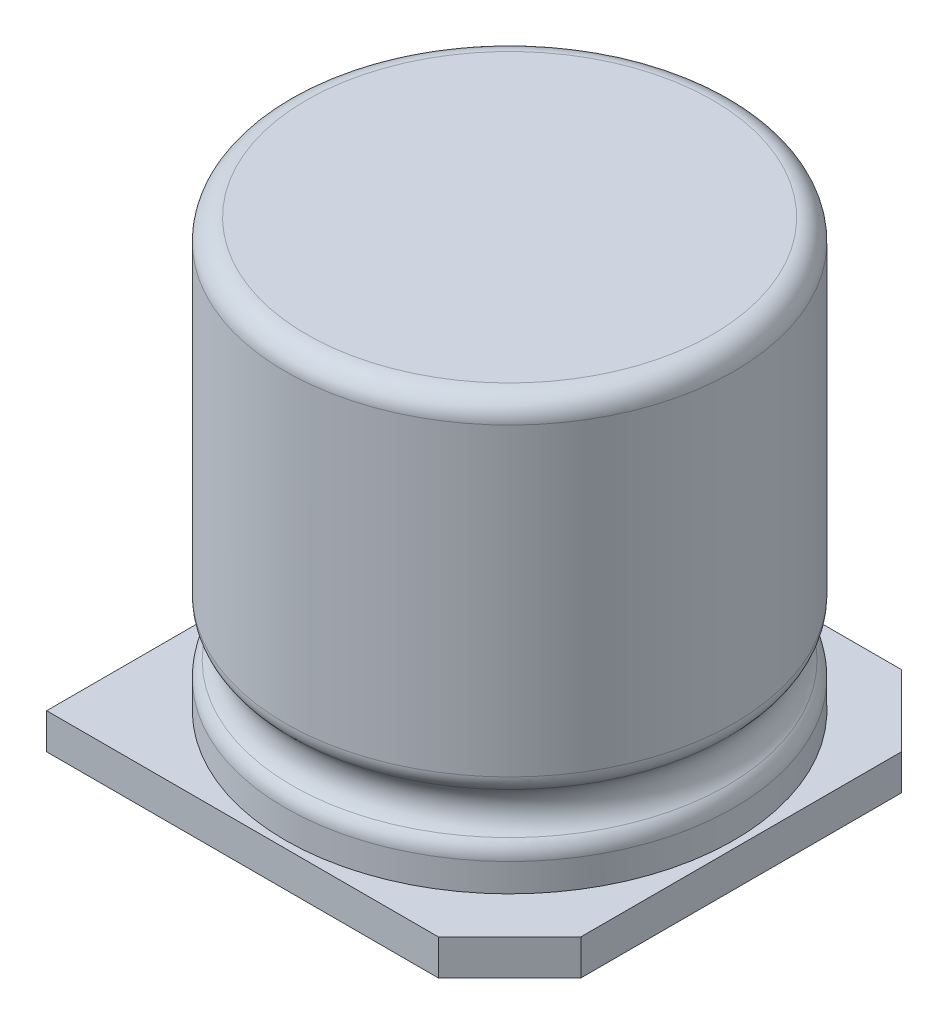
ISO-10303-21;
HEADER;
FILE_DESCRIPTION(('STEP AP214'),'2;1');
FILE_NAME('part.step','',(''),(''),'','','');
FILE_SCHEMA(('AUTOMOTIVE_DESIGN { 1 0 10303 214 1 1 1 1 }'));
ENDSEC;
DATA;
#1=APPLICATION_CONTEXT('core data for automotive mechanical design processes');
#2=APPLICATION_PROTOCOL_DEFINITION('international standard','automotive_design',2000,#1);
#3=PRODUCT_CONTEXT('',#1,'mechanical');
#4=PRODUCT('Part','Part','',(#3));
#5=PRODUCT_RELATED_PRODUCT_CATEGORY('part','',(#4));
#6=PRODUCT_DEFINITION_FORMATION('','',#4);
#7=PRODUCT_DEFINITION_CONTEXT('part definition',#1,'design');
#8=PRODUCT_DEFINITION('design','',#6,#7);
#9=PRODUCT_DEFINITION_SHAPE('','',#8);
#10=(LENGTH_UNIT() NAMED_UNIT(*) SI_UNIT(.MILLI.,.METRE.));
#11=(NAMED_UNIT(*) PLANE_ANGLE_UNIT() SI_UNIT($,.RADIAN.));
#12=(NAMED_UNIT(*) SI_UNIT($,.STERADIAN.) SOLID_ANGLE_UNIT());
#13=UNCERTAINTY_MEASURE_WITH_UNIT(LENGTH_MEASURE(1.E-05),#10,'distance_accuracy_value','');
#14=(GEOMETRIC_REPRESENTATION_CONTEXT(3) GLOBAL_UNCERTAINTY_ASSIGNED_CONTEXT((#13)) GLOBAL_UNIT_ASSIGNED_CONTEXT((#10,
#11,#12)) REPRESENTATION_CONTEXT('',''));
#15=CARTESIAN_POINT('',(0.,0.,0.));
#16=DIRECTION('',(0.,0.,1.));
#17=DIRECTION('',(1.,0.,0.));
#18=AXIS2_PLACEMENT_3D('',#15,#16,#17);
#19=CARTESIAN_POINT('',(29.11856,18.034,-32.9285599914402));
#20=DIRECTION('',(0.,1.,0.));
#21=DIRECTION('',(-1.,0.,0.));
#22=AXIS2_PLACEMENT_3D('',#19,#20,#21);
#23=PLANE('',#22);
#24=CARTESIAN_POINT('',(21.59,18.034,-25.4));
#25=DIRECTION('',(0.,-1.,0.));
#26=DIRECTION('',(1.,0.,1.39228393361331E-12));
#27=AXIS2_PLACEMENT_3D('',#24,#25,#26);
#28=CIRCLE('',#27,7.23899999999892);
#29=CARTESIAN_POINT('',(14.3510000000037,18.034,-25.4000000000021));
#30=VERTEX_POINT('',#29);
#31=CARTESIAN_POINT('',(28.8289999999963,18.034,-25.3999999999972));
#32=VERTEX_POINT('',#31);
#33=EDGE_CURVE('E82',#30,#32,#28,.F.);
#34=ORIENTED_EDGE('',*,*,#33,.T.);
#35=CARTESIAN_POINT('',(14.3510000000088,18.034,-25.4000000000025));
#36=CARTESIAN_POINT('',(14.3509997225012,18.034,-25.4430710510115));
#37=CARTESIAN_POINT('',(14.351383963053,18.0339999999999,-25.4861421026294));
#38=CARTESIAN_POINT('',(14.352921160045,18.0339999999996,-25.5722705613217));
#39=CARTESIAN_POINT('',(14.3540741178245,18.0339999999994,-25.6153279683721));
#40=CARTESIAN_POINT('',(14.3571484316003,18.0339999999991,-25.7014154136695));
#41=CARTESIAN_POINT('',(14.3590697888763,18.033999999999,-25.7444454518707));
#42=CARTESIAN_POINT('',(14.3636802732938,18.0339999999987,-25.8304644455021));
#43=CARTESIAN_POINT('',(14.3663694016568,18.0339999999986,-25.8734534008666));
#44=CARTESIAN_POINT('',(14.3725145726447,18.0339999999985,-25.9593765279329));
#45=CARTESIAN_POINT('',(14.3759706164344,18.0339999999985,-26.0023106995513));
#46=CARTESIAN_POINT('',(14.3836485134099,18.0339999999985,-26.0881105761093));
#47=CARTESIAN_POINT('',(14.3878703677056,18.0339999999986,-26.1309762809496));
#48=CARTESIAN_POINT('',(14.3970785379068,18.0339999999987,-26.2166255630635));
#49=CARTESIAN_POINT('',(14.4020648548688,18.0339999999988,-26.2594091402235));
#50=CARTESIAN_POINT('',(14.4128003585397,18.033999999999,-26.3448805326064));
#51=CARTESIAN_POINT('',(14.4185495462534,18.0339999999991,-26.3875683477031));
#52=CARTESIAN_POINT('',(14.430808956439,18.0339999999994,-26.4728346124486));
#53=CARTESIAN_POINT('',(14.437319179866,18.0339999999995,-26.5154130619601));
#54=CARTESIAN_POINT('',(14.4510985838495,18.0339999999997,-26.6004470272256));
#55=CARTESIAN_POINT('',(14.458367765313,18.0339999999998,-26.6429025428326));
#56=CARTESIAN_POINT('',(14.4736627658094,18.0339999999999,-26.7276771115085));
#57=CARTESIAN_POINT('',(14.4816885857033,18.0339999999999,-26.7699961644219));
#58=CARTESIAN_POINT('',(14.4984943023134,18.034,-26.854484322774));
#59=CARTESIAN_POINT('',(14.5072741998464,18.034,-26.8966534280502));
#60=CARTESIAN_POINT('',(14.5255852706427,18.034,-26.9808282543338));
#61=CARTESIAN_POINT('',(14.53511644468,18.034,-27.0228339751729));
#62=CARTESIAN_POINT('',(14.5549270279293,18.0339999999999,-27.1066686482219));
#63=CARTESIAN_POINT('',(14.5652064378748,18.0339999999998,-27.1484976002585));
#64=CARTESIAN_POINT('',(14.5865102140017,18.0339999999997,-27.2319654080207));
#65=CARTESIAN_POINT('',(14.5975345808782,18.0339999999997,-27.2736042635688));
#66=CARTESIAN_POINT('',(14.6203247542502,18.0339999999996,-27.3566786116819));
#67=CARTESIAN_POINT('',(14.6320905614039,18.0339999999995,-27.3981141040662));
#68=CARTESIAN_POINT('',(14.6563598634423,18.0339999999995,-27.4807685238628));
#69=CARTESIAN_POINT('',(14.668863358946,18.0339999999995,-27.5219874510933));
#70=CARTESIAN_POINT('',(14.6946040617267,18.0339999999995,-27.604195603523));
#71=CARTESIAN_POINT('',(14.7078412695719,18.0339999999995,-27.6451848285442));
#72=CARTESIAN_POINT('',(14.735045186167,18.0339999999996,-27.7269205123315));
#73=CARTESIAN_POINT('',(14.7490118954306,18.0339999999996,-27.7676669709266));
#74=CARTESIAN_POINT('',(14.7776703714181,18.0339999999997,-27.8489041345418));
#75=CARTESIAN_POINT('',(14.7923621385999,18.0339999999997,-27.8893948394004));
#76=CARTESIAN_POINT('',(14.8224660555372,18.0339999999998,-27.9701075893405));
#77=CARTESIAN_POINT('',(14.8378782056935,18.0339999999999,-28.0103296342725));
#78=CARTESIAN_POINT('',(14.8694179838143,18.0339999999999,-28.0904922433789));
#79=CARTESIAN_POINT('',(14.8855456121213,18.0339999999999,-28.1304328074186));
#80=CARTESIAN_POINT('',(14.9185112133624,18.034,-28.2100197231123));
#81=CARTESIAN_POINT('',(14.9353491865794,18.034,-28.2496660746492));
#82=CARTESIAN_POINT('',(14.9697301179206,18.034,-28.328651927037));
#83=CARTESIAN_POINT('',(14.9872730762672,18.034,-28.3679914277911));
#84=CARTESIAN_POINT('',(15.0230583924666,18.034,-28.4463510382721));
#85=CARTESIAN_POINT('',(15.0413007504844,18.034,-28.4853711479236));
#86=CARTESIAN_POINT('',(15.0784790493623,18.034,-28.5630795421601));
#87=CARTESIAN_POINT('',(15.0974149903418,18.034,-28.6017678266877));
#88=CARTESIAN_POINT('',(15.1359744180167,18.034,-28.6788002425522));
#89=CARTESIAN_POINT('',(15.1555979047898,18.034,-28.7171443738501));
#90=CARTESIAN_POINT('',(15.1955261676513,18.034,-28.793476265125));
#91=CARTESIAN_POINT('',(15.2158309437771,18.034,-28.8314640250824));
#92=CARTESIAN_POINT('',(15.2571153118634,18.034,-28.9070710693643));
#93=CARTESIAN_POINT('',(15.2780949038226,18.034,-28.9446903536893));
#94=CARTESIAN_POINT('',(15.3207222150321,18.034,-29.0195484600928));
#95=CARTESIAN_POINT('',(15.3423699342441,18.034,-29.0567872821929));
#96=CARTESIAN_POINT('',(15.3863265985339,18.034,-29.1308725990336));
#97=CARTESIAN_POINT('',(15.4086355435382,18.034,-29.1677190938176));
#98=CARTESIAN_POINT('',(15.4539075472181,18.034,-29.2410080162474));
#99=CARTESIAN_POINT('',(15.4768706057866,18.034,-29.2774504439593));
#100=CARTESIAN_POINT('',(15.523443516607,18.034,-29.3499196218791));
#101=CARTESIAN_POINT('',(15.5470533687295,18.034,-29.3859463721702));
#102=CARTESIAN_POINT('',(15.5949123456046,18.034,-29.4575727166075));
#103=CARTESIAN_POINT('',(15.6191614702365,18.034,-29.4931723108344));
#104=CARTESIAN_POINT('',(15.6682912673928,18.034,-29.5639330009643));
#105=CARTESIAN_POINT('',(15.6931719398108,18.034,-29.5990940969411));
#106=CARTESIAN_POINT('',(15.7435569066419,18.034,-29.6689665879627));
#107=CARTESIAN_POINT('',(15.7690612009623,18.034,-29.7036779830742));
#108=CARTESIAN_POINT('',(15.820685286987,18.034,-29.7726400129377));
#109=CARTESIAN_POINT('',(15.8468050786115,18.034,-29.8068906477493));
#110=CARTESIAN_POINT('',(15.8996518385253,18.034,-29.8749202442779));
#111=CARTESIAN_POINT('',(15.9263788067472,18.034,-29.9086992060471));
#112=CARTESIAN_POINT('',(15.9804314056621,18.034,-29.9757746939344));
#113=CARTESIAN_POINT('',(16.0077570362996,18.034,-30.0090712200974));
#114=CARTESIAN_POINT('',(16.0629982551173,18.034,-30.0751712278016));
#115=CARTESIAN_POINT('',(16.090913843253,18.034,-30.1079747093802));
#116=CARTESIAN_POINT('',(16.1473260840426,18.034,-30.1730781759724));
#117=CARTESIAN_POINT('',(16.1758227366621,18.034,-30.205378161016));
#118=CARTESIAN_POINT('',(16.23338802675,18.034,-30.2694643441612));
#119=CARTESIAN_POINT('',(16.2624566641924,18.034,-30.3012505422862));
#120=CARTESIAN_POINT('',(16.3211566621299,18.034,-30.364299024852));
#121=CARTESIAN_POINT('',(16.3507880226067,18.034,-30.3955613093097));
#122=CARTESIAN_POINT('',(16.4106040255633,18.034,-30.4575520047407));
#123=CARTESIAN_POINT('',(16.4407886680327,18.034,-30.4882804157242));
#124=CARTESIAN_POINT('',(16.5017016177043,18.034,-30.5491935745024));
#125=CARTESIAN_POINT('',(16.5324299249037,18.034,-30.5793783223));
#126=CARTESIAN_POINT('',(16.5944204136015,18.034,-30.6391945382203));
#127=CARTESIAN_POINT('',(16.6256825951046,18.034,-30.6688260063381));
#128=CARTESIAN_POINT('',(16.6887308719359,18.034,-30.7275262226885));
#129=CARTESIAN_POINT('',(16.7205169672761,18.034,-30.7565949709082));
#130=CARTESIAN_POINT('',(16.7846029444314,18.034,-30.8141604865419));
#131=CARTESIAN_POINT('',(16.8169028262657,18.034,-30.8426572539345));
#132=CARTESIAN_POINT('',(16.8820060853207,18.034,-30.8990697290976));
#133=CARTESIAN_POINT('',(16.9148094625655,18.034,-30.92698543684));
#134=CARTESIAN_POINT('',(16.9809092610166,18.034,-30.9822268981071));
#135=CARTESIAN_POINT('',(17.0142056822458,18.034,-31.0095526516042));
#136=CARTESIAN_POINT('',(17.0812809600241,18.034,-31.0636054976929));
#137=CARTESIAN_POINT('',(17.1150598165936,18.034,-31.0903325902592));
#138=CARTESIAN_POINT('',(17.183089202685,18.034,-31.1431795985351));
#139=CARTESIAN_POINT('',(17.2173397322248,18.034,-31.1692995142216));
#140=CARTESIAN_POINT('',(17.2863015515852,18.034,-31.2209238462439));
#141=CARTESIAN_POINT('',(17.3210128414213,18.034,-31.2464282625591));
#142=CARTESIAN_POINT('',(17.3908851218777,18.034,-31.2968134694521));
#143=CARTESIAN_POINT('',(17.4260461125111,18.034,-31.3216942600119));
#144=CARTESIAN_POINT('',(17.4968065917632,18.034,-31.3708242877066));
#145=CARTESIAN_POINT('',(17.5324060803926,18.034,-31.3950735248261));
#146=CARTESIAN_POINT('',(17.6040322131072,18.034,-31.4429327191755));
#147=CARTESIAN_POINT('',(17.6400588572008,18.034,-31.4665426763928));
#148=CARTESIAN_POINT('',(17.7125278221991,18.034,-31.5131157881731));
#149=CARTESIAN_POINT('',(17.74897014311,18.034,-31.5360789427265));
#150=CARTESIAN_POINT('',(17.8222588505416,18.034,-31.5813511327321));
#151=CARTESIAN_POINT('',(17.8591052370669,18.034,-31.603660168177));
#152=CARTESIAN_POINT('',(17.9331903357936,18.034,-31.64761701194));
#153=CARTESIAN_POINT('',(17.9704290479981,18.034,-31.6692648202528));
#154=CARTESIAN_POINT('',(18.0452869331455,18.034,-31.7118923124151));
#155=CARTESIAN_POINT('',(18.08290610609,18.034,-31.7328719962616));
#156=CARTESIAN_POINT('',(18.1585129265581,18.034,-31.7741565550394));
#157=CARTESIAN_POINT('',(18.1965005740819,18.034,-31.7944614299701));
#158=CARTESIAN_POINT('',(18.2728322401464,18.034,-31.8343899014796));
#159=CARTESIAN_POINT('',(18.3111762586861,18.034,-31.8540134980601));
#160=CARTESIAN_POINT('',(18.3882084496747,18.034,-31.892573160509));
#161=CARTESIAN_POINT('',(18.4268966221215,18.034,-31.9115092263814));
#162=CARTESIAN_POINT('',(18.5046047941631,18.034,-31.9486877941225));
#163=CARTESIAN_POINT('',(18.543624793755,18.034,-31.9669302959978));
#164=CARTESIAN_POINT('',(18.6219841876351,18.034,-32.002715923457));
#165=CARTESIAN_POINT('',(18.6613235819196,18.034,-32.0202590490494));
#166=CARTESIAN_POINT('',(18.7403092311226,18.034,-32.0546403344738));
#167=CARTESIAN_POINT('',(18.7799554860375,18.034,-32.0714784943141));
#168=CARTESIAN_POINT('',(18.8595422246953,18.034,-32.1044444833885));
#169=CARTESIAN_POINT('',(18.8994827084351,18.034,-32.12057231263));
#170=CARTESIAN_POINT('',(18.9796451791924,18.034,-32.1521125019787));
#171=CARTESIAN_POINT('',(19.0198671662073,18.034,-32.1675248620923));
#172=CARTESIAN_POINT('',(19.1005798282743,18.034,-32.1976292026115));
#173=CARTESIAN_POINT('',(19.1410705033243,18.034,-32.2123211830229));
#174=CARTESIAN_POINT('',(19.2223076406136,18.034,-32.2409800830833));
#175=CARTESIAN_POINT('',(19.2630541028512,18.034,-32.2549470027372));
#176=CARTESIAN_POINT('',(19.3447898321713,18.034,-32.2821513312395));
#177=CARTESIAN_POINT('',(19.3857790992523,18.034,-32.2953887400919));
#178=CARTESIAN_POINT('',(19.4679873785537,18.034,-32.3211298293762));
#179=CARTESIAN_POINT('',(19.5092063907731,18.034,-32.3336335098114));
#180=CARTESIAN_POINT('',(19.5918610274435,18.034,-32.3579031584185));
#181=CARTESIAN_POINT('',(19.6332966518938,18.034,-32.3696691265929));
#182=CARTESIAN_POINT('',(19.7163713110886,18.034,-32.3924596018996));
#183=CARTESIAN_POINT('',(19.7580103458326,18.034,-32.4034841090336));
#184=CARTESIAN_POINT('',(19.8414785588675,18.034,-32.424788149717));
#185=CARTESIAN_POINT('',(19.8833077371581,18.034,-32.4350676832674));
#186=CARTESIAN_POINT('',(19.9671429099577,18.034,-32.4548785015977));
#187=CARTESIAN_POINT('',(20.0091489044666,18.034,-32.4644097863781));
#188=CARTESIAN_POINT('',(20.0933243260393,18.034,-32.4827210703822));
#189=CARTESIAN_POINT('',(20.1354937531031,18.034,-32.4915010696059));
#190=CARTESIAN_POINT('',(20.219982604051,18.034,-32.5083069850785));
#191=CARTESIAN_POINT('',(20.2623020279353,18.034,-32.5163329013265));
#192=CARTESIAN_POINT('',(20.3470773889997,18.034,-32.5316280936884));
#193=CARTESIAN_POINT('',(20.38953332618,18.034,-32.5388973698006));
#194=CARTESIAN_POINT('',(20.4745681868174,18.034,-32.5526769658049));
#195=CARTESIAN_POINT('',(20.5171471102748,18.034,-32.5591872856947));
#196=CARTESIAN_POINT('',(20.602414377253,18.034,-32.5714468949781));
#197=CARTESIAN_POINT('',(20.6451027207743,18.034,-32.577196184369));
#198=CARTESIAN_POINT('',(20.730575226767,18.034,-32.5879319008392));
#199=CARTESIAN_POINT('',(20.7733593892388,18.034,-32.5929183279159));
#200=CARTESIAN_POINT('',(20.8590099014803,18.034,-32.6021267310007));
#201=CARTESIAN_POINT('',(20.9018762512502,18.034,-32.6063487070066));
#202=CARTESIAN_POINT('',(20.9876774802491,18.034,-32.614026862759));
#203=CARTESIAN_POINT('',(21.0306123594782,18.034,-32.6174830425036));
#204=CARTESIAN_POINT('',(21.1165369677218,18.034,-32.6236285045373));
#205=CARTESIAN_POINT('',(21.1595266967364,18.034,-32.626317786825));
#206=CARTESIAN_POINT('',(21.2455473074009,18.034,-32.6309285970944));
#207=CARTESIAN_POINT('',(21.2885781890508,18.034,-32.6328501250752));
#208=CARTESIAN_POINT('',(21.374667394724,18.034,-32.6359248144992));
#209=CARTESIAN_POINT('',(21.4177257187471,18.034,-32.6370779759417));
#210=CARTESIAN_POINT('',(21.5038560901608,18.034,-32.6386155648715));
#211=CARTESIAN_POINT('',(21.5469281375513,18.034,-32.6389999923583));
#212=CARTESIAN_POINT('',(21.6330722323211,18.034,-32.6389999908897));
#213=CARTESIAN_POINT('',(21.6761442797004,18.034,-32.6386155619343));
#214=CARTESIAN_POINT('',(21.7622746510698,18.034,-32.637077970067));
#215=CARTESIAN_POINT('',(21.80533297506,18.034,-32.6359248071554));
#216=CARTESIAN_POINT('',(21.8914221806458,18.034,-32.6328501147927));
#217=CARTESIAN_POINT('',(21.9344530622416,18.034,-32.6309285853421));
#218=CARTESIAN_POINT('',(22.020473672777,18.034,-32.6263177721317));
#219=CARTESIAN_POINT('',(22.0634634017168,18.034,-32.6236284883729));
#220=CARTESIAN_POINT('',(22.1493880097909,18.034,-32.6174830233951));
#221=CARTESIAN_POINT('',(22.1923228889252,18.034,-32.6140268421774));
#222=CARTESIAN_POINT('',(22.2781241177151,18.034,-32.6063486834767));
#223=CARTESIAN_POINT('',(22.3209904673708,18.034,-32.6021267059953));
#224=CARTESIAN_POINT('',(22.4066409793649,18.034,-32.5929182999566));
#225=CARTESIAN_POINT('',(22.4494251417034,18.034,-32.5879318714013));
#226=CARTESIAN_POINT('',(22.5348976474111,18.034,-32.5771961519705));
#227=CARTESIAN_POINT('',(22.5775859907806,18.034,-32.5714468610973));
#228=CARTESIAN_POINT('',(22.6628532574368,18.034,-32.5591872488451));
#229=CARTESIAN_POINT('',(22.7054321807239,18.034,-32.5526769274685));
#230=CARTESIAN_POINT('',(22.7904670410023,18.034,-32.5388973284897));
#231=CARTESIAN_POINT('',(22.8329229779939,18.034,-32.5316280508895));
#232=CARTESIAN_POINT('',(22.9176983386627,18.034,-32.5163328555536));
#233=CARTESIAN_POINT('',(22.9600177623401,18.034,-32.5083069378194));
#234=CARTESIAN_POINT('',(23.0445066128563,18.034,-32.4915010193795));
#235=CARTESIAN_POINT('',(23.0866760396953,18.034,-32.4827210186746));
#236=CARTESIAN_POINT('',(23.1708514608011,18.034,-32.4644097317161));
#237=CARTESIAN_POINT('',(23.2128574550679,18.034,-32.4548784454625));
#238=CARTESIAN_POINT('',(23.2966926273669,18.034,-32.435067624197));
#239=CARTESIAN_POINT('',(23.3385218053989,18.034,-32.4247880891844));
#240=CARTESIAN_POINT('',(23.4219900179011,18.034,-32.403484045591));
#241=CARTESIAN_POINT('',(23.463629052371,18.034,-32.3924595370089));
#242=CARTESIAN_POINT('',(23.5467037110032,18.034,-32.3696690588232));
#243=CARTESIAN_POINT('',(23.588139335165,18.034,-32.3579030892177));
#244=CARTESIAN_POINT('',(23.6707939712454,18.034,-32.3336334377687));
#245=CARTESIAN_POINT('',(23.7120129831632,18.034,-32.3211297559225));
#246=CARTESIAN_POINT('',(23.7942212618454,18.034,-32.2953886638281));
#247=CARTESIAN_POINT('',(23.8352105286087,18.034,-32.2821512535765));
#248=CARTESIAN_POINT('',(23.9169462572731,18.034,-32.2549469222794));
#249=CARTESIAN_POINT('',(23.9576927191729,18.034,-32.2409800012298));
#250=CARTESIAN_POINT('',(24.0389298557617,18.034,-32.2123210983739));
#251=CARTESIAN_POINT('',(24.079420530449,18.034,-32.1976291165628));
#252=CARTESIAN_POINT('',(24.1601331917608,18.034,-32.1675247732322));
#253=CARTESIAN_POINT('',(24.2003551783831,18.034,-32.1521124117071));
#254=CARTESIAN_POINT('',(24.2805176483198,18.034,-32.1205722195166));
#255=CARTESIAN_POINT('',(24.3204581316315,18.034,-32.1044443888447));
#256=CARTESIAN_POINT('',(24.4000448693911,18.034,-32.0714783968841));
#257=CARTESIAN_POINT('',(24.4396911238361,18.034,-32.054640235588));
#258=CARTESIAN_POINT('',(24.5186767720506,18.034,-32.02025894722));
#259=CARTESIAN_POINT('',(24.5580161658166,18.034,-32.00271582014));
#260=CARTESIAN_POINT('',(24.6363755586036,18.034,-31.9669301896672));
#261=CARTESIAN_POINT('',(24.6753955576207,18.034,-31.9486876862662));
#262=CARTESIAN_POINT('',(24.7531037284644,18.034,-31.9115091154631));
#263=CARTESIAN_POINT('',(24.7917919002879,18.034,-31.8925730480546));
#264=CARTESIAN_POINT('',(24.8688240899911,18.034,-31.8540133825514));
#265=CARTESIAN_POINT('',(24.9071681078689,18.034,-31.8343897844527));
#266=CARTESIAN_POINT('',(24.9834997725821,18.034,-31.7944613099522));
#267=CARTESIAN_POINT('',(25.0214874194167,18.034,-31.7741564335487));
#268=CARTESIAN_POINT('',(25.0970942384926,18.034,-31.7328718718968));
#269=CARTESIAN_POINT('',(25.1347134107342,18.034,-31.7118921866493));
#270=CARTESIAN_POINT('',(25.2095712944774,18.034,-31.6692646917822));
#271=CARTESIAN_POINT('',(25.2468100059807,18.034,-31.6476168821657));
#272=CARTESIAN_POINT('',(25.3208951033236,18.034,-31.6036600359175));
#273=CARTESIAN_POINT('',(25.3577414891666,18.034,-31.5813509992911));
#274=CARTESIAN_POINT('',(25.4310301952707,18.034,-31.5360788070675));
#275=CARTESIAN_POINT('',(25.4674725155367,18.034,-31.513115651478));
#276=CARTESIAN_POINT('',(25.539941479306,18.034,-31.4665425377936));
#277=CARTESIAN_POINT('',(25.5759681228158,18.034,-31.4429325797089));
#278=CARTESIAN_POINT('',(25.6475942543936,18.034,-31.3950733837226));
#279=CARTESIAN_POINT('',(25.6831937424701,18.034,-31.3708241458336));
#280=CARTESIAN_POINT('',(25.7539542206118,18.034,-31.3216941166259));
#281=CARTESIAN_POINT('',(25.7891152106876,18.034,-31.2968133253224));
#282=CARTESIAN_POINT('',(25.8589874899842,18.034,-31.2464281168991));
#283=CARTESIAN_POINT('',(25.8936987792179,18.034,-31.2209236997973));
#284=CARTESIAN_POINT('',(25.9626605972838,18.034,-31.1692993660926));
#285=CARTESIAN_POINT('',(25.9969111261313,18.034,-31.1431794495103));
#286=CARTESIAN_POINT('',(26.0649405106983,18.034,-31.0903324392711));
#287=CARTESIAN_POINT('',(26.0987193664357,18.034,-31.0636053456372));
#288=CARTESIAN_POINT('',(26.165794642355,18.034,-31.0095524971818));
#289=CARTESIAN_POINT('',(26.1990910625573,18.034,-30.9822267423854));
#290=CARTESIAN_POINT('',(26.2651908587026,18.034,-30.9269852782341));
#291=CARTESIAN_POINT('',(26.2979942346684,18.034,-30.8990695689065));
#292=CARTESIAN_POINT('',(26.3630974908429,18.034,-30.84265709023));
#293=CARTESIAN_POINT('',(26.3953973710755,18.034,-30.8141603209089));
#294=CARTESIAN_POINT('',(26.4594833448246,18.034,-30.7565948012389));
#295=CARTESIAN_POINT('',(26.4912694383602,18.034,-30.7275260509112));
#296=CARTESIAN_POINT('',(26.5543177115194,18.034,-30.6688258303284));
#297=CARTESIAN_POINT('',(26.585579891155,18.034,-30.6391943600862));
#298=CARTESIAN_POINT('',(26.6475703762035,18.034,-30.5793781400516));
#299=CARTESIAN_POINT('',(26.6782986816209,18.034,-30.5491933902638));
#300=CARTESIAN_POINT('',(26.7392116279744,18.034,-30.4882802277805));
#301=CARTESIAN_POINT('',(26.7693962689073,18.034,-30.4575518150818));
#302=CARTESIAN_POINT('',(26.8292122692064,18.034,-30.3955611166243));
#303=CARTESIAN_POINT('',(26.8588436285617,18.034,-30.364298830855));
#304=CARTESIAN_POINT('',(26.9175436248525,18.034,-30.3012503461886));
#305=CARTESIAN_POINT('',(26.9466122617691,18.034,-30.2694641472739));
#306=CARTESIAN_POINT('',(27.0041775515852,18.034,-30.2053779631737));
#307=CARTESIAN_POINT('',(27.0326742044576,18.034,-30.1730779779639));
#308=CARTESIAN_POINT('',(27.0890864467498,18.034,-30.1079745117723));
#309=CARTESIAN_POINT('',(27.1170020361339,18.034,-30.0751710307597));
#310=CARTESIAN_POINT('',(27.1722432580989,18.034,-30.0090710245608));
#311=CARTESIAN_POINT('',(27.1995688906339,18.034,-29.9757744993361));
#312=CARTESIAN_POINT('',(27.2536214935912,18.034,-29.908699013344));
#313=CARTESIAN_POINT('',(27.2803484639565,18.034,-29.8749200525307));
#314=CARTESIAN_POINT('',(27.333195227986,18.034,-29.8068904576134));
#315=CARTESIAN_POINT('',(27.3593150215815,18.034,-29.7726398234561));
#316=CARTESIAN_POINT('',(27.4109391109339,18.034,-29.7036777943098));
#317=CARTESIAN_POINT('',(27.43644340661,18.034,-29.6689663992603));
#318=CARTESIAN_POINT('',(27.486828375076,18.034,-29.5990939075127));
#319=CARTESIAN_POINT('',(27.5117090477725,18.034,-29.5639328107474));
#320=CARTESIAN_POINT('',(27.5608388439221,18.034,-29.4931721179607));
#321=CARTESIAN_POINT('',(27.5850879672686,18.034,-29.4575725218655));
#322=CARTESIAN_POINT('',(27.6329469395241,18.034,-29.3859461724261));
#323=CARTESIAN_POINT('',(27.6565567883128,18.034,-29.3499194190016));
#324=CARTESIAN_POINT('',(27.703129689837,18.034,-29.2774502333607));
#325=CARTESIAN_POINT('',(27.7260927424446,18.034,-29.2410078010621));
#326=CARTESIAN_POINT('',(27.7713647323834,18.034,-29.1677188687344));
#327=CARTESIAN_POINT('',(27.7936736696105,18.034,-29.1308723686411));
#328=CARTESIAN_POINT('',(27.8376303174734,18.034,-29.0567870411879));
#329=CARTESIAN_POINT('',(27.8592780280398,18.034,-29.019548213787));
#330=CARTESIAN_POINT('',(27.9019053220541,18.034,-28.9446900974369));
#331=CARTESIAN_POINT('',(27.922884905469,18.034,-28.9070708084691));
#332=CARTESIAN_POINT('',(27.9641692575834,18.034,-28.8314637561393));
#333=CARTESIAN_POINT('',(27.9844740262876,18.034,-28.79347599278));
#334=CARTESIAN_POINT('',(28.02440227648,18.034,-28.7171440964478));
#335=CARTESIAN_POINT('',(28.044025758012,18.034,-28.6787999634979));
#336=CARTESIAN_POINT('',(28.0825851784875,18.034,-28.6017675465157));
#337=CARTESIAN_POINT('',(28.1015211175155,18.034,-28.5630792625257));
#338=CARTESIAN_POINT('',(28.1386994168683,18.034,-28.4853708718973));
#339=CARTESIAN_POINT('',(28.1569417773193,18.034,-28.4463507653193));
#340=CARTESIAN_POINT('',(28.192727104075,18.034,-28.3679911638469));
#341=CARTESIAN_POINT('',(28.2102700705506,18.034,-28.3286516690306));
#342=CARTESIAN_POINT('',(28.2446510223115,18.034,-28.2496658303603));
#343=CARTESIAN_POINT('',(28.2614890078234,18.034,-28.210019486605));
#344=CARTESIAN_POINT('',(28.2944546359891,18.034,-28.1304325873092));
#345=CARTESIAN_POINT('',(28.3105822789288,18.034,-28.0904920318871));
#346=CARTESIAN_POINT('',(28.3421220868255,18.034,-28.010329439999));
#347=CARTESIAN_POINT('',(28.3575342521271,18.0339999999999,-27.9701074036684));
#348=CARTESIAN_POINT('',(28.3876381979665,18.0339999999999,-27.8893946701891));
#349=CARTESIAN_POINT('',(28.4023299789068,18.0339999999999,-27.8489039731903));
#350=CARTESIAN_POINT('',(28.4309884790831,18.0339999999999,-27.7676668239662));
#351=CARTESIAN_POINT('',(28.4449551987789,18.0339999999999,-27.7269203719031));
#352=CARTESIAN_POINT('',(28.472159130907,18.0339999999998,-27.6451846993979));
#353=CARTESIAN_POINT('',(28.4853963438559,18.0339999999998,-27.6041954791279));
#354=CARTESIAN_POINT('',(28.5111370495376,18.0339999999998,-27.5219873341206));
#355=CARTESIAN_POINT('',(28.523640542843,18.0339999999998,-27.4807684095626));
#356=CARTESIAN_POINT('',(28.5479098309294,18.0339999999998,-27.3981139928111));
#357=CARTESIAN_POINT('',(28.559675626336,18.0339999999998,-27.3566785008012));
#358=CARTESIAN_POINT('',(28.5824657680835,18.0339999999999,-27.2736041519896));
#359=CARTESIAN_POINT('',(28.5934901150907,18.0339999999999,-27.2319652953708));
#360=CARTESIAN_POINT('',(28.6147938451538,18.0339999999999,-27.1484974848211));
#361=CARTESIAN_POINT('',(28.6250732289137,18.034,-27.10666853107));
#362=CARTESIAN_POINT('',(28.6448837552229,18.034,-27.0228338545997));
#363=CARTESIAN_POINT('',(28.6544148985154,18.034,-26.9808281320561));
#364=CARTESIAN_POINT('',(28.6727259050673,18.034,-26.8966533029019));
#365=CARTESIAN_POINT('',(28.6815057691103,18.034,-26.8544841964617));
#366=CARTESIAN_POINT('',(28.6983114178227,18.0339999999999,-26.7699960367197));
#367=CARTESIAN_POINT('',(28.7063372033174,18.0339999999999,-26.7276769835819));
#368=CARTESIAN_POINT('',(28.7216321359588,18.0339999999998,-26.6429024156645));
#369=CARTESIAN_POINT('',(28.7289012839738,18.0339999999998,-26.6004469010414));
#370=CARTESIAN_POINT('',(28.7426806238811,18.0339999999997,-26.5154129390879));
#371=CARTESIAN_POINT('',(28.7491908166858,18.0339999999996,-26.4728344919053));
#372=CARTESIAN_POINT('',(28.7614501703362,18.0339999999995,-26.3875682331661));
#373=CARTESIAN_POINT('',(28.7671993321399,18.0339999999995,-26.3448804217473));
#374=CARTESIAN_POINT('',(28.7779347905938,18.0339999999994,-26.2594090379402));
#375=CARTESIAN_POINT('',(28.7829210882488,18.0339999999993,-26.2166254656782));
#376=CARTESIAN_POINT('',(28.7921292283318,18.0339999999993,-26.1309761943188));
#377=CARTESIAN_POINT('',(28.7963510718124,18.0339999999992,-26.0881104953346));
#378=CARTESIAN_POINT('',(28.80402895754,18.0339999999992,-26.0023106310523));
#379=CARTESIAN_POINT('',(28.8074850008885,18.0339999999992,-25.9593764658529));
#380=CARTESIAN_POINT('',(28.8136301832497,18.0339999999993,-25.8734533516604));
#381=CARTESIAN_POINT('',(28.816319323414,18.0339999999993,-25.8304644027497));
#382=CARTESIAN_POINT('',(28.8209298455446,18.0339999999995,-25.7444454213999));
#383=CARTESIAN_POINT('',(28.8228512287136,18.0339999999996,-25.7014153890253));
#384=CARTESIAN_POINT('',(28.8259256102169,18.0339999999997,-25.6153279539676));
#385=CARTESIAN_POINT('',(28.827078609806,18.0339999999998,-25.5722705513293));
#386=CARTESIAN_POINT('',(28.8286159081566,18.0339999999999,-25.4861420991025));
#387=CARTESIAN_POINT('',(28.8290002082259,18.034,-25.4430710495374));
#388=CARTESIAN_POINT('',(28.8289999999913,18.034,-25.3999999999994));
#389=B_SPLINE_CURVE_WITH_KNOTS('',3,(#35,#36,#37,#38,#39,#40,#41,#42,#43,#44,#45,#46,#47,#48,
#49,#50,#51,#52,#53,#54,#55,#56,#57,#58,#59,#60,#61,#62,#63,#64,#65,#66,#67,#68,#69,#70,#71,#72,
#73,#74,#75,#76,#77,#78,#79,#80,#81,#82,#83,#84,#85,#86,#87,#88,#89,#90,#91,#92,#93,#94,#95,#96,
#97,#98,#99,#100,#101,#102,#103,#104,#105,#106,#107,#108,#109,#110,#111,#112,#113,#114,#115,
#116,#117,#118,#119,#120,#121,#122,#123,#124,#125,#126,#127,#128,#129,#130,#131,#132,#133,#134,
#135,#136,#137,#138,#139,#140,#141,#142,#143,#144,#145,#146,#147,#148,#149,#150,#151,#152,#153,
#154,#155,#156,#157,#158,#159,#160,#161,#162,#163,#164,#165,#166,#167,#168,#169,#170,#171,#172,
#173,#174,#175,#176,#177,#178,#179,#180,#181,#182,#183,#184,#185,#186,#187,#188,#189,#190,#191,
#192,#193,#194,#195,#196,#197,#198,#199,#200,#201,#202,#203,#204,#205,#206,#207,#208,#209,#210,
#211,#212,#213,#214,#215,#216,#217,#218,#219,#220,#221,#222,#223,#224,#225,#226,#227,#228,#229,
#230,#231,#232,#233,#234,#235,#236,#237,#238,#239,#240,#241,#242,#243,#244,#245,#246,#247,#248,
#249,#250,#251,#252,#253,#254,#255,#256,#257,#258,#259,#260,#261,#262,#263,#264,#265,#266,#267,
#268,#269,#270,#271,#272,#273,#274,#275,#276,#277,#278,#279,#280,#281,#282,#283,#284,#285,#286,
#287,#288,#289,#290,#291,#292,#293,#294,#295,#296,#297,#298,#299,#300,#301,#302,#303,#304,#305,
#306,#307,#308,#309,#310,#311,#312,#313,#314,#315,#316,#317,#318,#319,#320,#321,#322,#323,#324,
#325,#326,#327,#328,#329,#330,#331,#332,#333,#334,#335,#336,#337,#338,#339,#340,#341,#342,#343,
#344,#345,#346,#347,#348,#349,#350,#351,#352,#353,#354,#355,#356,#357,#358,#359,#360,#361,#362,
#363,#364,#365,#366,#367,#368,#369,#370,#371,#372,#373,#374,#375,#376,#377,#378,#379,#380,#381,
#382,#383,#384,#385,#386,#387,#388),.UNSPECIFIED.,.F.,.F.,(4,2,2,2,2,2,2,2,2,2,2,2,2,2,2,2,2,2,
2,2,2,2,2,2,2,2,2,2,2,2,2,2,2,2,2,2,2,2,2,2,2,2,2,2,2,2,2,2,2,2,2,2,2,2,2,2,2,2,2,2,2,2,2,2,2,2,
2,2,2,2,2,2,2,2,2,2,2,2,2,2,2,2,2,2,2,2,2,2,2,2,2,2,2,2,2,2,2,2,2,2,2,2,2,2,2,2,2,2,2,2,2,2,2,2,
2,2,2,2,2,2,2,2,2,2,2,2,2,2,2,2,2,2,2,2,2,2,2,2,2,2,2,2,2,2,2,2,2,2,2,2,2,2,2,2,2,2,2,2,2,2,2,2,
2,2,2,2,2,2,2,2,2,2,2,2,2,2,4),(0.,0.129211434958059,0.258423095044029,0.387634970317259,
0.516847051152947,0.646059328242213,0.775271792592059,0.90448443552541,1.03369724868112,
1.16291022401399,1.29212335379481,1.42133663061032,1.55055004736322,1.67976359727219,
1.8089772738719,1.93819107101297,2.06740498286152,2.19661900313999,2.3258331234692,
2.45504733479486,2.58426162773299,2.71347599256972,2.84269041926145,2.97190489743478,
3.10111941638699,3.23033396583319,3.35954853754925,3.48876312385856,3.61797771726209,
3.74719231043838,3.87640689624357,4.00562146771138,4.13483601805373,4.26405054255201,
4.39326504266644,4.52247952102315,4.65169398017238,4.78090842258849,4.91012285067,
5.03933726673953,5.16855167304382,5.29776607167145,5.42698046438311,5.55619485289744,
5.68540923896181,5.81462362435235,5.94383801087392,6.07305240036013,6.20226679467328,
6.3314811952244,6.46069560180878,6.58991001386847,6.71912443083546,6.84833885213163,
6.97755327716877,7.1067677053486,7.23598213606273,7.36519656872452,7.49441100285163,
7.62362543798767,7.75283987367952,7.88205430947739,8.01126874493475,8.14048317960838,
8.26969761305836,8.39891204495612,8.52812647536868,8.65734090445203,8.78655533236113,
8.91576975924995,9.0449841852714,9.17419861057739,9.30341303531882,9.43262745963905,
9.5618418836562,9.69105630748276,9.8202707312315,9.94948515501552,10.0786995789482,
10.2079140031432,10.3371284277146,10.4663428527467,10.5955572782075,10.7247717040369,
10.8539861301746,10.9832005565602,11.1124149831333,11.2416294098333,11.3708438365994,
11.5000582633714,11.6292726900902,11.7584871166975,11.8877015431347,12.0169159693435,
12.1461303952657,12.2753448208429,12.404559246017,12.5337736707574,12.6629880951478,
12.7922025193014,12.921416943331,13.0506313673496,13.1798457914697,13.309060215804,
13.4382746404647,13.5674890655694,13.6967034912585,13.8259179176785,13.9551323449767,
14.0843467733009,14.2135612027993,14.3427756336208,14.4719900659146,14.6012044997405,
14.7304189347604,14.8596333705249,14.988847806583,15.1180622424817,15.2472766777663,
15.3764911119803,15.5057055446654,15.6349199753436,15.7641344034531,15.8933488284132,
16.0225632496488,16.1517776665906,16.2809920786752,16.4102064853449,16.5394208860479,
16.668635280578,16.7978496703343,16.9270640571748,17.0562784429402,17.1854928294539,
17.3147072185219,17.4439216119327,17.5731360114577,17.7023504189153,17.8315648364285,
17.9607792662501,18.0899937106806,18.2192081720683,18.3484226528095,18.4776371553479,
18.6068516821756,18.736066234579,18.865280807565,18.9944953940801,19.1237099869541,
19.2529245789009,19.3821391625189,19.5113537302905,19.6405682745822,19.7697827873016,
19.8989972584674,20.0282116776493,20.1574260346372,20.2866403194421,20.4158545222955,
20.5450686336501,20.6742826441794,20.8034965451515,20.9327103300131,21.0619239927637,
21.1911375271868,21.3203509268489,21.4495641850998,21.5787772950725,21.7079902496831,
21.8372030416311,21.9664156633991,22.095628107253,22.2248403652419,22.3540524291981,
22.4832642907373,22.6124759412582,22.741687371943),.UNSPECIFIED.);
#390=EDGE_CURVE('E85',#32,#30,#389,.F.);
#391=ORIENTED_EDGE('',*,*,#390,.T.);
#392=EDGE_LOOP('',(#34,#391));
#393=FACE_BOUND('',#392,.T.);
#394=ADVANCED_FACE('F16',(#393),#23,.T.);
#395=CARTESIAN_POINT('',(21.59,17.272,-25.4));
#396=DIRECTION('',(0.,1.,0.));
#397=DIRECTION('',(0.999984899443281,0.,0.00549553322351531));
#398=AXIS2_PLACEMENT_3D('',#395,#396,#397);
#399=TOROIDAL_SURFACE('',#398,7.23899999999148,0.762);
#400=CARTESIAN_POINT('',(21.59,17.2719999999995,-25.4));
#401=DIRECTION('',(0.,1.,0.));
#402=DIRECTION('',(-1.,0.,0.));
#403=AXIS2_PLACEMENT_3D('',#400,#401,#402);
#404=CIRCLE('',#403,8.001);
#405=CARTESIAN_POINT('',(13.589,17.2719999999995,-25.4));
#406=VERTEX_POINT('',#405);
#407=EDGE_CURVE('E91',#406,#406,#404,.T.);
#408=ORIENTED_EDGE('',*,*,#407,.T.);
#409=EDGE_LOOP('',(#408));
#410=FACE_BOUND('',#409,.T.);
#411=ORIENTED_EDGE('',*,*,#33,.F.);
#412=ORIENTED_EDGE('',*,*,#390,.F.);
#413=EDGE_LOOP('',(#411,#412));
#414=FACE_BOUND('',#413,.T.);
#415=ADVANCED_FACE('F84',(#410,#414),#399,.T.);
#416=CARTESIAN_POINT('',(21.59,6.40396289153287,-25.4));
#417=DIRECTION('',(0.,1.,0.));
#418=DIRECTION('',(0.,0.,1.));
#419=AXIS2_PLACEMENT_3D('',#416,#417,#418);
#420=CYLINDRICAL_SURFACE('',#419,8.001);
#421=CARTESIAN_POINT('',(21.59,6.40396289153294,-25.4));
#422=DIRECTION('',(0.,1.,0.));
#423=DIRECTION('',(0.999983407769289,0.,0.00576057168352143));
#424=AXIS2_PLACEMENT_3D('',#421,#422,#423);
#425=CIRCLE('',#424,8.00099999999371);
#426=CARTESIAN_POINT('',(29.5908672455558,6.40396289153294,-25.3539096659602));
#427=VERTEX_POINT('',#426);
#428=EDGE_CURVE('E205',#427,#427,#425,.T.);
#429=ORIENTED_EDGE('',*,*,#428,.T.);
#430=EDGE_LOOP('',(#429));
#431=FACE_BOUND('',#430,.T.);
#432=ORIENTED_EDGE('',*,*,#407,.F.);
#433=EDGE_LOOP('',(#432));
#434=FACE_BOUND('',#433,.T.);
#435=ADVANCED_FACE('F223',(#431,#434),#420,.T.);
#436=CARTESIAN_POINT('',(21.59,6.40396289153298,-25.4));
#437=DIRECTION('',(0.,1.,0.));
#438=DIRECTION('',(0.999983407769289,0.,0.0057605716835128));
#439=AXIS2_PLACEMENT_3D('',#436,#437,#438);
#440=TOROIDAL_SURFACE('',#439,7.23899999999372,0.762);
#441=CARTESIAN_POINT('',(21.59,5.84079641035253,-25.4));
#442=DIRECTION('',(0.,-1.,0.));
#443=DIRECTION('',(1.,0.,0.));
#444=AXIS2_PLACEMENT_3D('',#441,#442,#443);
#445=CIRCLE('',#444,7.75231034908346);
#446=CARTESIAN_POINT('',(29.3423103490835,5.84079641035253,-25.4));
#447=VERTEX_POINT('',#446);
#448=EDGE_CURVE('E203',#447,#447,#445,.T.);
#449=ORIENTED_EDGE('',*,*,#448,.F.);
#450=EDGE_LOOP('',(#449));
#451=FACE_BOUND('',#450,.T.);
#452=ORIENTED_EDGE('',*,*,#428,.F.);
#453=EDGE_LOOP('',(#452));
#454=FACE_BOUND('',#453,.T.);
#455=ADVANCED_FACE('F198',(#451,#454),#440,.T.);
#456=CARTESIAN_POINT('',(21.59,5.09830724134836,-25.4));
#457=DIRECTION('',(0.,-1.,0.));
#458=DIRECTION('',(1.,0.,0.));
#459=AXIS2_PLACEMENT_3D('',#456,#457,#458);
#460=TOROIDAL_SURFACE('',#459,8.4290682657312,1.00463498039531);
#461=CARTESIAN_POINT('',(21.59,4.35581807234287,-25.4));
#462=DIRECTION('',(0.,1.,0.));
#463=DIRECTION('',(-0.999986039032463,0.,0.00528410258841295));
#464=AXIS2_PLACEMENT_3D('',#461,#462,#463);
#465=CIRCLE('',#464,7.75231034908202);
#466=CARTESIAN_POINT('',(13.8377978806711,4.35581807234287,-25.3590359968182));
#467=VERTEX_POINT('',#466);
#468=EDGE_CURVE('E190',#467,#467,#465,.T.);
#469=ORIENTED_EDGE('',*,*,#468,.T.);
#470=EDGE_LOOP('',(#469));
#471=FACE_BOUND('',#470,.T.);
#472=ORIENTED_EDGE('',*,*,#448,.T.);
#473=EDGE_LOOP('',(#472));
#474=FACE_BOUND('',#473,.T.);
#475=ADVANCED_FACE('F118',(#471,#474),#460,.F.);
#476=CARTESIAN_POINT('',(30.1752,1.524,-16.8148));
#477=DIRECTION('',(0.,-1.,0.));
#478=DIRECTION('',(-1.,0.,0.));
#479=AXIS2_PLACEMENT_3D('',#476,#477,#478);
#480=PLANE('',#479);
#481=DIRECTION('',(-0.707106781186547,0.,-0.707106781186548));
#482=VECTOR('',#481,1.);
#483=CARTESIAN_POINT('',(28.575,1.524,-32.385));
#484=LINE('',#483,#482);
#485=CARTESIAN_POINT('',(29.845,1.524,-31.115));
#486=VERTEX_POINT('',#485);
#487=CARTESIAN_POINT('',(27.305,1.524,-33.655));
#488=VERTEX_POINT('',#487);
#489=EDGE_CURVE('E364',#486,#488,#484,.T.);
#490=ORIENTED_EDGE('',*,*,#489,.F.);
#491=DIRECTION('',(0.,0.,-1.));
#492=VECTOR('',#491,1.);
#493=CARTESIAN_POINT('',(29.845,1.524,-25.4));
#494=LINE('',#493,#492);
#495=CARTESIAN_POINT('',(29.845,1.524,-19.685));
#496=VERTEX_POINT('',#495);
#497=EDGE_CURVE('E57',#496,#486,#494,.T.);
#498=ORIENTED_EDGE('',*,*,#497,.F.);
#499=DIRECTION('',(0.707106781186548,0.,-0.707106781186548));
#500=VECTOR('',#499,1.);
#501=CARTESIAN_POINT('',(28.575,1.524,-18.415));
#502=LINE('',#501,#500);
#503=CARTESIAN_POINT('',(27.305,1.524,-17.145));
#504=VERTEX_POINT('',#503);
#505=EDGE_CURVE('E178',#504,#496,#502,.T.);
#506=ORIENTED_EDGE('',*,*,#505,.F.);
#507=DIRECTION('',(1.,0.,0.));
#508=VECTOR('',#507,1.);
#509=CARTESIAN_POINT('',(20.32,1.524,-17.145));
#510=LINE('',#509,#508);
#511=CARTESIAN_POINT('',(13.335,1.524,-17.145));
#512=VERTEX_POINT('',#511);
#513=EDGE_CURVE('E177',#512,#504,#510,.T.);
#514=ORIENTED_EDGE('',*,*,#513,.F.);
#515=DIRECTION('',(0.,0.,1.));
#516=VECTOR('',#515,1.);
#517=CARTESIAN_POINT('',(13.335,1.524,-25.4));
#518=LINE('',#517,#516);
#519=CARTESIAN_POINT('',(13.335,1.524,-33.655));
#520=VERTEX_POINT('',#519);
#521=EDGE_CURVE('E374',#520,#512,#518,.T.);
#522=ORIENTED_EDGE('',*,*,#521,.F.);
#523=DIRECTION('',(-1.,0.,0.));
#524=VECTOR('',#523,1.);
#525=CARTESIAN_POINT('',(20.32,1.524,-33.655));
#526=LINE('',#525,#524);
#527=EDGE_CURVE('E369',#488,#520,#526,.T.);
#528=ORIENTED_EDGE('',*,*,#527,.F.);
#529=EDGE_LOOP('',(#490,#498,#506,#514,#522,#528));
#530=FACE_BOUND('',#529,.T.);
#531=ADVANCED_FACE('F113',(#530),#480,.T.);
#532=CARTESIAN_POINT('',(21.59,3.7926515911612,-25.4));
#533=DIRECTION('',(0.,1.,0.));
#534=DIRECTION('',(-0.999986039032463,0.,0.00528410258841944));
#535=AXIS2_PLACEMENT_3D('',#532,#533,#534);
#536=TOROIDAL_SURFACE('',#535,7.23900000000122,0.762);
#537=ORIENTED_EDGE('',*,*,#468,.F.);
#538=EDGE_LOOP('',(#537));
#539=FACE_BOUND('',#538,.T.);
#540=CARTESIAN_POINT('',(21.59,3.79265159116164,-25.4));
#541=DIRECTION('',(0.,1.,0.));
#542=DIRECTION('',(-1.,0.,0.));
#543=AXIS2_PLACEMENT_3D('',#540,#541,#542);
#544=CIRCLE('',#543,8.001);
#545=CARTESIAN_POINT('',(13.589,3.79265159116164,-25.4));
#546=VERTEX_POINT('',#545);
#547=EDGE_CURVE('E171',#546,#546,#544,.T.);
#548=ORIENTED_EDGE('',*,*,#547,.T.);
#549=EDGE_LOOP('',(#548));
#550=FACE_BOUND('',#549,.T.);
#551=ADVANCED_FACE('F117',(#539,#550),#536,.T.);
#552=CARTESIAN_POINT('',(27.2542,1.48968460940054,-17.0942));
#553=DIRECTION('',(0.707106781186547,0.,0.707106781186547));
#554=DIRECTION('',(0.707106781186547,0.,-0.707106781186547));
#555=AXIS2_PLACEMENT_3D('',#552,#553,#554);
#556=PLANE('',#555);
#557=ORIENTED_EDGE('',*,*,#505,.T.);
#558=DIRECTION('',(0.,-1.,0.));
#559=VECTOR('',#558,1.);
#560=CARTESIAN_POINT('',(29.845,2.159,-19.685));
#561=LINE('',#560,#559);
#562=CARTESIAN_POINT('',(29.845,2.79399999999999,-19.685));
#563=VERTEX_POINT('',#562);
#564=EDGE_CURVE('E173',#563,#496,#561,.T.);
#565=ORIENTED_EDGE('',*,*,#564,.F.);
#566=DIRECTION('',(0.707106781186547,0.,-0.707106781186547));
#567=VECTOR('',#566,1.);
#568=CARTESIAN_POINT('',(27.2542,2.79399999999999,-17.0942));
#569=LINE('',#568,#567);
#570=CARTESIAN_POINT('',(27.305,2.79399999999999,-17.145));
#571=VERTEX_POINT('',#570);
#572=EDGE_CURVE('E49',#563,#571,#569,.F.);
#573=ORIENTED_EDGE('',*,*,#572,.T.);
#574=DIRECTION('',(0.,1.,0.));
#575=VECTOR('',#574,1.);
#576=CARTESIAN_POINT('',(27.305,2.159,-17.145));
#577=LINE('',#576,#575);
#578=EDGE_CURVE('E175',#504,#571,#577,.T.);
#579=ORIENTED_EDGE('',*,*,#578,.F.);
#580=EDGE_LOOP('',(#557,#565,#573,#579));
#581=FACE_BOUND('',#580,.T.);
#582=ADVANCED_FACE('F120',(#581),#556,.T.);
#583=CARTESIAN_POINT('',(27.5844,2.82831539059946,-17.145));
#584=DIRECTION('',(0.,0.,1.));
#585=DIRECTION('',(-1.,0.,0.));
#586=AXIS2_PLACEMENT_3D('',#583,#584,#585);
#587=PLANE('',#586);
#588=DIRECTION('',(0.,1.,0.));
#589=VECTOR('',#588,1.);
#590=CARTESIAN_POINT('',(13.335,2.159,-17.145));
#591=LINE('',#590,#589);
#592=CARTESIAN_POINT('',(13.335,2.79399999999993,-17.145));
#593=VERTEX_POINT('',#592);
#594=EDGE_CURVE('E371',#512,#593,#591,.T.);
#595=ORIENTED_EDGE('',*,*,#594,.F.);
#596=ORIENTED_EDGE('',*,*,#513,.T.);
#597=ORIENTED_EDGE('',*,*,#578,.T.);
#598=DIRECTION('',(-1.,0.,0.));
#599=VECTOR('',#598,1.);
#600=CARTESIAN_POINT('',(21.59,2.794,-17.145));
#601=LINE('',#600,#599);
#602=EDGE_CURVE('E167',#571,#593,#601,.T.);
#603=ORIENTED_EDGE('',*,*,#602,.T.);
#604=EDGE_LOOP('',(#595,#596,#597,#603));
#605=FACE_BOUND('',#604,.T.);
#606=ADVANCED_FACE('F123',(#605),#587,.T.);
#607=CARTESIAN_POINT('',(13.335,2.82831539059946,-16.8148));
#608=DIRECTION('',(-1.,0.,0.));
#609=DIRECTION('',(0.,0.,-1.));
#610=AXIS2_PLACEMENT_3D('',#607,#608,#609);
#611=PLANE('',#610);
#612=ORIENTED_EDGE('',*,*,#521,.T.);
#613=ORIENTED_EDGE('',*,*,#594,.T.);
#614=DIRECTION('',(0.,0.,-1.));
#615=VECTOR('',#614,1.);
#616=CARTESIAN_POINT('',(13.335,2.794,-25.4));
#617=LINE('',#616,#615);
#618=CARTESIAN_POINT('',(13.335,2.79399999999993,-33.655));
#619=VERTEX_POINT('',#618);
#620=EDGE_CURVE('E166',#593,#619,#617,.T.);
#621=ORIENTED_EDGE('',*,*,#620,.T.);
#622=DIRECTION('',(0.,1.,0.));
#623=VECTOR('',#622,1.);
#624=CARTESIAN_POINT('',(13.335,2.159,-33.655));
#625=LINE('',#624,#623);
#626=EDGE_CURVE('E165',#520,#619,#625,.T.);
#627=ORIENTED_EDGE('',*,*,#626,.F.);
#628=EDGE_LOOP('',(#612,#613,#621,#627));
#629=FACE_BOUND('',#628,.T.);
#630=ADVANCED_FACE('F127',(#629),#611,.T.);
#631=CARTESIAN_POINT('',(13.0556,2.82831539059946,-33.655));
#632=DIRECTION('',(0.,0.,-1.));
#633=DIRECTION('',(1.,0.,0.));
#634=AXIS2_PLACEMENT_3D('',#631,#632,#633);
#635=PLANE('',#634);
#636=ORIENTED_EDGE('',*,*,#626,.T.);
#637=DIRECTION('',(1.,0.,0.));
#638=VECTOR('',#637,1.);
#639=CARTESIAN_POINT('',(21.59,2.794,-33.655));
#640=LINE('',#639,#638);
#641=CARTESIAN_POINT('',(27.305,2.79399999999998,-33.655));
#642=VERTEX_POINT('',#641);
#643=EDGE_CURVE('E159',#619,#642,#640,.T.);
#644=ORIENTED_EDGE('',*,*,#643,.T.);
#645=DIRECTION('',(0.,1.,0.));
#646=VECTOR('',#645,1.);
#647=CARTESIAN_POINT('',(27.3050000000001,2.159,-33.6549999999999));
#648=LINE('',#647,#646);
#649=EDGE_CURVE('E100',#488,#642,#648,.T.);
#650=ORIENTED_EDGE('',*,*,#649,.F.);
#651=ORIENTED_EDGE('',*,*,#527,.T.);
#652=EDGE_LOOP('',(#636,#644,#650,#651));
#653=FACE_BOUND('',#652,.T.);
#654=ADVANCED_FACE('F131',(#653),#635,.T.);
#655=CARTESIAN_POINT('',(29.8958,1.48968460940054,-31.0642));
#656=DIRECTION('',(0.707106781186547,0.,-0.707106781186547));
#657=DIRECTION('',(-0.707106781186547,0.,-0.707106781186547));
#658=AXIS2_PLACEMENT_3D('',#655,#656,#657);
#659=PLANE('',#658);
#660=ORIENTED_EDGE('',*,*,#489,.T.);
#661=ORIENTED_EDGE('',*,*,#649,.T.);
#662=DIRECTION('',(-0.707106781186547,0.,-0.707106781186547));
#663=VECTOR('',#662,1.);
#664=CARTESIAN_POINT('',(29.8958,2.79399999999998,-31.0642));
#665=LINE('',#664,#663);
#666=CARTESIAN_POINT('',(29.845,2.79399999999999,-31.115));
#667=VERTEX_POINT('',#666);
#668=EDGE_CURVE('E156',#642,#667,#665,.F.);
#669=ORIENTED_EDGE('',*,*,#668,.T.);
#670=DIRECTION('',(0.,1.,0.));
#671=VECTOR('',#670,1.);
#672=CARTESIAN_POINT('',(29.845,2.159,-31.115));
#673=LINE('',#672,#671);
#674=EDGE_CURVE('E37',#486,#667,#673,.T.);
#675=ORIENTED_EDGE('',*,*,#674,.F.);
#676=EDGE_LOOP('',(#660,#661,#669,#675));
#677=FACE_BOUND('',#676,.T.);
#678=ADVANCED_FACE('F135',(#677),#659,.T.);
#679=CARTESIAN_POINT('',(29.845,2.82831539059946,-31.3436));
#680=DIRECTION('',(1.,0.,0.));
#681=DIRECTION('',(0.,0.,1.));
#682=AXIS2_PLACEMENT_3D('',#679,#680,#681);
#683=PLANE('',#682);
#684=ORIENTED_EDGE('',*,*,#674,.T.);
#685=DIRECTION('',(0.,0.,1.));
#686=VECTOR('',#685,1.);
#687=CARTESIAN_POINT('',(29.845,2.794,-25.4));
#688=LINE('',#687,#686);
#689=EDGE_CURVE('E28',#667,#563,#688,.T.);
#690=ORIENTED_EDGE('',*,*,#689,.T.);
#691=ORIENTED_EDGE('',*,*,#564,.T.);
#692=ORIENTED_EDGE('',*,*,#497,.T.);
#693=EDGE_LOOP('',(#684,#690,#691,#692));
#694=FACE_BOUND('',#693,.T.);
#695=ADVANCED_FACE('F138',(#694),#683,.T.);
#696=CARTESIAN_POINT('',(21.59,2.79400000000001,-25.4));
#697=DIRECTION('',(0.,1.,0.));
#698=DIRECTION('',(0.,0.,1.));
#699=AXIS2_PLACEMENT_3D('',#696,#697,#698);
#700=CYLINDRICAL_SURFACE('',#699,8.001);
#701=CARTESIAN_POINT('',(21.59,2.79400000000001,-25.4));
#702=DIRECTION('',(0.,1.,0.));
#703=DIRECTION('',(0.,0.,1.));
#704=AXIS2_PLACEMENT_3D('',#701,#702,#703);
#705=CIRCLE('',#704,8.001);
#706=CARTESIAN_POINT('',(21.59,2.79400000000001,-17.399));
#707=VERTEX_POINT('',#706);
#708=EDGE_CURVE('E11',#707,#707,#705,.T.);
#709=ORIENTED_EDGE('',*,*,#708,.T.);
#710=EDGE_LOOP('',(#709));
#711=FACE_BOUND('',#710,.T.);
#712=ORIENTED_EDGE('',*,*,#547,.F.);
#713=EDGE_LOOP('',(#712));
#714=FACE_BOUND('',#713,.T.);
#715=ADVANCED_FACE('F141',(#711,#714),#700,.T.);
#716=CARTESIAN_POINT('',(30.1752,2.794,-16.8148));
#717=DIRECTION('',(0.,-1.,0.));
#718=DIRECTION('',(-1.,0.,0.));
#719=AXIS2_PLACEMENT_3D('',#716,#717,#718);
#720=PLANE('',#719);
#721=ORIENTED_EDGE('',*,*,#708,.F.);
#722=EDGE_LOOP('',(#721));
#723=FACE_BOUND('',#722,.T.);
#724=ORIENTED_EDGE('',*,*,#668,.F.);
#725=ORIENTED_EDGE('',*,*,#643,.F.);
#726=ORIENTED_EDGE('',*,*,#620,.F.);
#727=ORIENTED_EDGE('',*,*,#602,.F.);
#728=ORIENTED_EDGE('',*,*,#572,.F.);
#729=ORIENTED_EDGE('',*,*,#689,.F.);
#730=EDGE_LOOP('',(#724,#725,#726,#727,#728,#729));
#731=FACE_BOUND('',#730,.T.);
#732=ADVANCED_FACE('F18',(#723,#731),#720,.F.);
#733=CLOSED_SHELL('',(#394,#415,#435,#455,#475,#531,#551,#582,#606,#630,#654,#678,#695,#715,#732));
#734=MANIFOLD_SOLID_BREP('B1',#733);
#735=ADVANCED_BREP_SHAPE_REPRESENTATION('',(#18,#734),#14);
#736=SHAPE_DEFINITION_REPRESENTATION(#9,#735);
ENDSEC;
END-ISO-10303-21;
